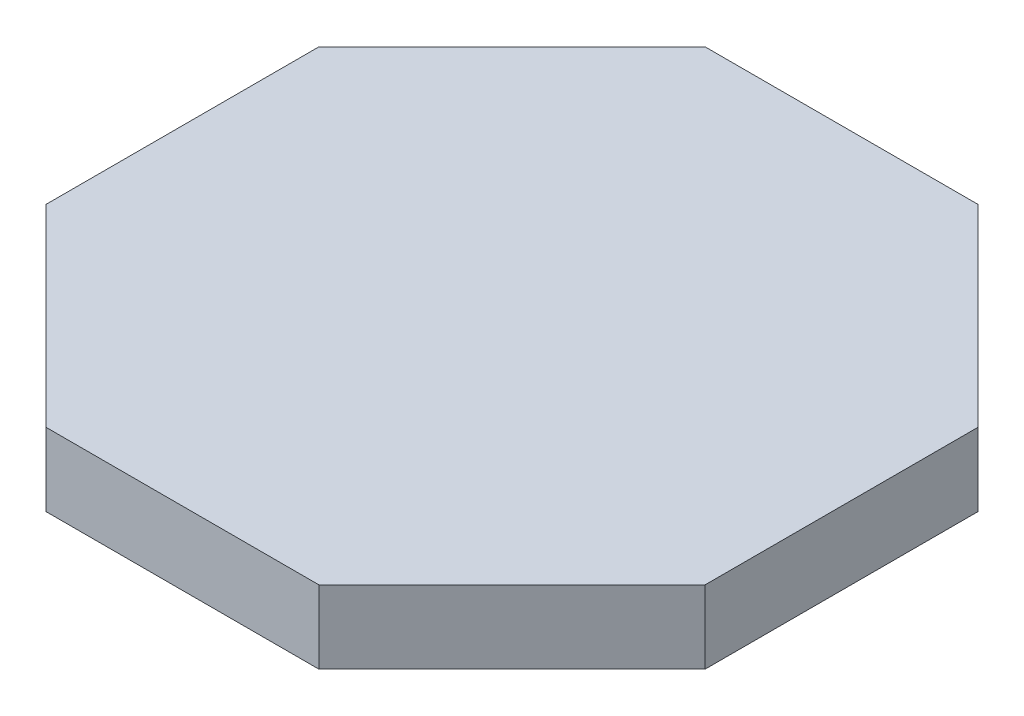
ISO-10303-21;
HEADER;
FILE_DESCRIPTION(('STEP AP214'),'2;1');
FILE_NAME('part.step','',(''),(''),'','','');
FILE_SCHEMA(('AUTOMOTIVE_DESIGN { 1 0 10303 214 1 1 1 1 }'));
ENDSEC;
DATA;
#1=APPLICATION_CONTEXT('core data for automotive mechanical design processes');
#2=APPLICATION_PROTOCOL_DEFINITION('international standard','automotive_design',2000,#1);
#3=PRODUCT_CONTEXT('',#1,'mechanical');
#4=PRODUCT('Part','Part','',(#3));
#5=PRODUCT_RELATED_PRODUCT_CATEGORY('part','',(#4));
#6=PRODUCT_DEFINITION_FORMATION('','',#4);
#7=PRODUCT_DEFINITION_CONTEXT('part definition',#1,'design');
#8=PRODUCT_DEFINITION('design','',#6,#7);
#9=PRODUCT_DEFINITION_SHAPE('','',#8);
#10=(LENGTH_UNIT() NAMED_UNIT(*) SI_UNIT(.MILLI.,.METRE.));
#11=(NAMED_UNIT(*) PLANE_ANGLE_UNIT() SI_UNIT($,.RADIAN.));
#12=(NAMED_UNIT(*) SI_UNIT($,.STERADIAN.) SOLID_ANGLE_UNIT());
#13=UNCERTAINTY_MEASURE_WITH_UNIT(LENGTH_MEASURE(1.E-05),#10,'distance_accuracy_value','');
#14=(GEOMETRIC_REPRESENTATION_CONTEXT(3) GLOBAL_UNCERTAINTY_ASSIGNED_CONTEXT((#13)) GLOBAL_UNIT_ASSIGNED_CONTEXT((#10,
#11,#12)) REPRESENTATION_CONTEXT('',''));
#15=CARTESIAN_POINT('',(0.,0.,0.));
#16=DIRECTION('',(0.,0.,1.));
#17=DIRECTION('',(1.,0.,0.));
#18=AXIS2_PLACEMENT_3D('',#15,#16,#17);
#19=CARTESIAN_POINT('',(36.0924927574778,8.,-14.95));
#20=DIRECTION('',(-0.707106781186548,0.,0.707106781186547));
#21=DIRECTION('',(0.707106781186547,0.,0.707106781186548));
#22=AXIS2_PLACEMENT_3D('',#19,#20,#21);
#23=PLANE('',#22);
#24=DIRECTION('',(-0.707106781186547,0.,-0.707106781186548));
#25=VECTOR('',#24,1.);
#26=CARTESIAN_POINT('',(36.0924927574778,0.,-14.95));
#27=LINE('',#26,#25);
#28=CARTESIAN_POINT('',(36.0924927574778,0.,-14.95));
#29=VERTEX_POINT('',#28);
#30=CARTESIAN_POINT('',(14.95,0.,-36.0924927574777));
#31=VERTEX_POINT('',#30);
#32=EDGE_CURVE('E129',#29,#31,#27,.T.);
#33=ORIENTED_EDGE('',*,*,#32,.T.);
#34=DIRECTION('',(0.,-1.,0.));
#35=VECTOR('',#34,1.);
#36=CARTESIAN_POINT('',(14.95,8.,-36.0924927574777));
#37=LINE('',#36,#35);
#38=CARTESIAN_POINT('',(14.95,8.,-36.0924927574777));
#39=VERTEX_POINT('',#38);
#40=EDGE_CURVE('E11',#39,#31,#37,.T.);
#41=ORIENTED_EDGE('',*,*,#40,.F.);
#42=DIRECTION('',(-0.707106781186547,0.,-0.707106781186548));
#43=VECTOR('',#42,1.);
#44=CARTESIAN_POINT('',(36.0924927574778,8.,-14.95));
#45=LINE('',#44,#43);
#46=CARTESIAN_POINT('',(36.0924927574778,8.,-14.95));
#47=VERTEX_POINT('',#46);
#48=EDGE_CURVE('E143',#47,#39,#45,.T.);
#49=ORIENTED_EDGE('',*,*,#48,.F.);
#50=DIRECTION('',(0.,-1.,0.));
#51=VECTOR('',#50,1.);
#52=CARTESIAN_POINT('',(36.0924927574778,8.,-14.95));
#53=LINE('',#52,#51);
#54=EDGE_CURVE('E125',#47,#29,#53,.T.);
#55=ORIENTED_EDGE('',*,*,#54,.T.);
#56=EDGE_LOOP('',(#33,#41,#49,#55));
#57=FACE_BOUND('',#56,.T.);
#58=ADVANCED_FACE('F33',(#57),#23,.F.);
#59=CARTESIAN_POINT('',(14.95,8.,-36.0924927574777));
#60=DIRECTION('',(0.,0.,1.));
#61=DIRECTION('',(1.,0.,0.));
#62=AXIS2_PLACEMENT_3D('',#59,#60,#61);
#63=PLANE('',#62);
#64=DIRECTION('',(-1.,0.,0.));
#65=VECTOR('',#64,1.);
#66=CARTESIAN_POINT('',(14.95,0.,-36.0924927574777));
#67=LINE('',#66,#65);
#68=CARTESIAN_POINT('',(-14.95,0.,-36.0924927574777));
#69=VERTEX_POINT('',#68);
#70=EDGE_CURVE('E132',#31,#69,#67,.T.);
#71=ORIENTED_EDGE('',*,*,#70,.T.);
#72=DIRECTION('',(0.,-1.,0.));
#73=VECTOR('',#72,1.);
#74=CARTESIAN_POINT('',(-14.95,8.,-36.0924927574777));
#75=LINE('',#74,#73);
#76=CARTESIAN_POINT('',(-14.95,8.,-36.0924927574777));
#77=VERTEX_POINT('',#76);
#78=EDGE_CURVE('E41',#77,#69,#75,.T.);
#79=ORIENTED_EDGE('',*,*,#78,.F.);
#80=DIRECTION('',(-1.,0.,0.));
#81=VECTOR('',#80,1.);
#82=CARTESIAN_POINT('',(14.95,8.,-36.0924927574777));
#83=LINE('',#82,#81);
#84=EDGE_CURVE('E92',#39,#77,#83,.T.);
#85=ORIENTED_EDGE('',*,*,#84,.F.);
#86=ORIENTED_EDGE('',*,*,#40,.T.);
#87=EDGE_LOOP('',(#71,#79,#85,#86));
#88=FACE_BOUND('',#87,.T.);
#89=ADVANCED_FACE('F178',(#88),#63,.F.);
#90=CARTESIAN_POINT('',(-14.95,8.,-36.0924927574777));
#91=DIRECTION('',(0.707106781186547,0.,0.707106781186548));
#92=DIRECTION('',(0.707106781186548,0.,-0.707106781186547));
#93=AXIS2_PLACEMENT_3D('',#90,#91,#92);
#94=PLANE('',#93);
#95=DIRECTION('',(-0.707106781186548,0.,0.707106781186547));
#96=VECTOR('',#95,1.);
#97=CARTESIAN_POINT('',(-14.95,0.,-36.0924927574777));
#98=LINE('',#97,#96);
#99=CARTESIAN_POINT('',(-36.0924927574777,0.,-14.95));
#100=VERTEX_POINT('',#99);
#101=EDGE_CURVE('E134',#69,#100,#98,.T.);
#102=ORIENTED_EDGE('',*,*,#101,.T.);
#103=DIRECTION('',(0.,-1.,0.));
#104=VECTOR('',#103,1.);
#105=CARTESIAN_POINT('',(-36.0924927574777,8.,-14.95));
#106=LINE('',#105,#104);
#107=CARTESIAN_POINT('',(-36.0924927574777,8.,-14.95));
#108=VERTEX_POINT('',#107);
#109=EDGE_CURVE('E150',#108,#100,#106,.T.);
#110=ORIENTED_EDGE('',*,*,#109,.F.);
#111=DIRECTION('',(-0.707106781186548,0.,0.707106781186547));
#112=VECTOR('',#111,1.);
#113=CARTESIAN_POINT('',(-14.95,8.,-36.0924927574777));
#114=LINE('',#113,#112);
#115=EDGE_CURVE('E158',#77,#108,#114,.T.);
#116=ORIENTED_EDGE('',*,*,#115,.F.);
#117=ORIENTED_EDGE('',*,*,#78,.T.);
#118=EDGE_LOOP('',(#102,#110,#116,#117));
#119=FACE_BOUND('',#118,.T.);
#120=ADVANCED_FACE('F156',(#119),#94,.F.);
#121=CARTESIAN_POINT('',(-36.0924927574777,8.,-14.95));
#122=DIRECTION('',(1.,0.,0.));
#123=DIRECTION('',(0.,0.,-1.));
#124=AXIS2_PLACEMENT_3D('',#121,#122,#123);
#125=PLANE('',#124);
#126=DIRECTION('',(0.,0.,1.));
#127=VECTOR('',#126,1.);
#128=CARTESIAN_POINT('',(-36.0924927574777,0.,-14.95));
#129=LINE('',#128,#127);
#130=CARTESIAN_POINT('',(-36.0924927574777,0.,14.95));
#131=VERTEX_POINT('',#130);
#132=EDGE_CURVE('E136',#100,#131,#129,.T.);
#133=ORIENTED_EDGE('',*,*,#132,.T.);
#134=DIRECTION('',(0.,-1.,0.));
#135=VECTOR('',#134,1.);
#136=CARTESIAN_POINT('',(-36.0924927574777,8.,14.95));
#137=LINE('',#136,#135);
#138=CARTESIAN_POINT('',(-36.0924927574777,8.,14.95));
#139=VERTEX_POINT('',#138);
#140=EDGE_CURVE('E147',#139,#131,#137,.T.);
#141=ORIENTED_EDGE('',*,*,#140,.F.);
#142=DIRECTION('',(0.,0.,1.));
#143=VECTOR('',#142,1.);
#144=CARTESIAN_POINT('',(-36.0924927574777,8.,-14.95));
#145=LINE('',#144,#143);
#146=EDGE_CURVE('E170',#108,#139,#145,.T.);
#147=ORIENTED_EDGE('',*,*,#146,.F.);
#148=ORIENTED_EDGE('',*,*,#109,.T.);
#149=EDGE_LOOP('',(#133,#141,#147,#148));
#150=FACE_BOUND('',#149,.T.);
#151=ADVANCED_FACE('F166',(#150),#125,.F.);
#152=CARTESIAN_POINT('',(-36.0924927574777,8.,14.95));
#153=DIRECTION('',(0.707106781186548,0.,-0.707106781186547));
#154=DIRECTION('',(-0.707106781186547,0.,-0.707106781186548));
#155=AXIS2_PLACEMENT_3D('',#152,#153,#154);
#156=PLANE('',#155);
#157=DIRECTION('',(0.707106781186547,0.,0.707106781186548));
#158=VECTOR('',#157,1.);
#159=CARTESIAN_POINT('',(-36.0924927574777,0.,14.95));
#160=LINE('',#159,#158);
#161=CARTESIAN_POINT('',(-14.95,0.,36.0924927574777));
#162=VERTEX_POINT('',#161);
#163=EDGE_CURVE('E138',#131,#162,#160,.T.);
#164=ORIENTED_EDGE('',*,*,#163,.T.);
#165=DIRECTION('',(0.,-1.,0.));
#166=VECTOR('',#165,1.);
#167=CARTESIAN_POINT('',(-14.95,8.,36.0924927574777));
#168=LINE('',#167,#166);
#169=CARTESIAN_POINT('',(-14.95,8.,36.0924927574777));
#170=VERTEX_POINT('',#169);
#171=EDGE_CURVE('E120',#170,#162,#168,.T.);
#172=ORIENTED_EDGE('',*,*,#171,.F.);
#173=DIRECTION('',(0.707106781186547,0.,0.707106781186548));
#174=VECTOR('',#173,1.);
#175=CARTESIAN_POINT('',(-36.0924927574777,8.,14.95));
#176=LINE('',#175,#174);
#177=EDGE_CURVE('E111',#139,#170,#176,.T.);
#178=ORIENTED_EDGE('',*,*,#177,.F.);
#179=ORIENTED_EDGE('',*,*,#140,.T.);
#180=EDGE_LOOP('',(#164,#172,#178,#179));
#181=FACE_BOUND('',#180,.T.);
#182=ADVANCED_FACE('F169',(#181),#156,.F.);
#183=CARTESIAN_POINT('',(-14.95,8.,36.0924927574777));
#184=DIRECTION('',(0.,0.,-1.));
#185=DIRECTION('',(-1.,0.,0.));
#186=AXIS2_PLACEMENT_3D('',#183,#184,#185);
#187=PLANE('',#186);
#188=DIRECTION('',(1.,0.,0.));
#189=VECTOR('',#188,1.);
#190=CARTESIAN_POINT('',(-14.95,0.,36.0924927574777));
#191=LINE('',#190,#189);
#192=CARTESIAN_POINT('',(14.95,0.,36.0924927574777));
#193=VERTEX_POINT('',#192);
#194=EDGE_CURVE('E119',#162,#193,#191,.T.);
#195=ORIENTED_EDGE('',*,*,#194,.T.);
#196=DIRECTION('',(0.,-1.,0.));
#197=VECTOR('',#196,1.);
#198=CARTESIAN_POINT('',(14.95,8.,36.0924927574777));
#199=LINE('',#198,#197);
#200=CARTESIAN_POINT('',(14.95,8.,36.0924927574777));
#201=VERTEX_POINT('',#200);
#202=EDGE_CURVE('E116',#201,#193,#199,.T.);
#203=ORIENTED_EDGE('',*,*,#202,.F.);
#204=DIRECTION('',(1.,0.,0.));
#205=VECTOR('',#204,1.);
#206=CARTESIAN_POINT('',(-14.95,8.,36.0924927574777));
#207=LINE('',#206,#205);
#208=EDGE_CURVE('E105',#170,#201,#207,.T.);
#209=ORIENTED_EDGE('',*,*,#208,.F.);
#210=ORIENTED_EDGE('',*,*,#171,.T.);
#211=EDGE_LOOP('',(#195,#203,#209,#210));
#212=FACE_BOUND('',#211,.T.);
#213=ADVANCED_FACE('F117',(#212),#187,.F.);
#214=CARTESIAN_POINT('',(14.95,8.,36.0924927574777));
#215=DIRECTION('',(-0.707106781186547,0.,-0.707106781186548));
#216=DIRECTION('',(-0.707106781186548,0.,0.707106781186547));
#217=AXIS2_PLACEMENT_3D('',#214,#215,#216);
#218=PLANE('',#217);
#219=DIRECTION('',(0.707106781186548,0.,-0.707106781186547));
#220=VECTOR('',#219,1.);
#221=CARTESIAN_POINT('',(14.95,0.,36.0924927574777));
#222=LINE('',#221,#220);
#223=CARTESIAN_POINT('',(36.0924927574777,0.,14.95));
#224=VERTEX_POINT('',#223);
#225=EDGE_CURVE('E78',#193,#224,#222,.T.);
#226=ORIENTED_EDGE('',*,*,#225,.T.);
#227=DIRECTION('',(0.,-1.,0.));
#228=VECTOR('',#227,1.);
#229=CARTESIAN_POINT('',(36.0924927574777,8.,14.95));
#230=LINE('',#229,#228);
#231=CARTESIAN_POINT('',(36.0924927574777,8.,14.95));
#232=VERTEX_POINT('',#231);
#233=EDGE_CURVE('E121',#232,#224,#230,.T.);
#234=ORIENTED_EDGE('',*,*,#233,.F.);
#235=DIRECTION('',(0.707106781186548,0.,-0.707106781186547));
#236=VECTOR('',#235,1.);
#237=CARTESIAN_POINT('',(14.95,8.,36.0924927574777));
#238=LINE('',#237,#236);
#239=EDGE_CURVE('E109',#201,#232,#238,.T.);
#240=ORIENTED_EDGE('',*,*,#239,.F.);
#241=ORIENTED_EDGE('',*,*,#202,.T.);
#242=EDGE_LOOP('',(#226,#234,#240,#241));
#243=FACE_BOUND('',#242,.T.);
#244=ADVANCED_FACE('F123',(#243),#218,.F.);
#245=CARTESIAN_POINT('',(36.0924927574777,8.,14.95));
#246=DIRECTION('',(-1.,0.,0.));
#247=DIRECTION('',(0.,0.,1.));
#248=AXIS2_PLACEMENT_3D('',#245,#246,#247);
#249=PLANE('',#248);
#250=DIRECTION('',(0.,0.,-1.));
#251=VECTOR('',#250,1.);
#252=CARTESIAN_POINT('',(36.0924927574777,0.,14.95));
#253=LINE('',#252,#251);
#254=EDGE_CURVE('E84',#224,#29,#253,.T.);
#255=ORIENTED_EDGE('',*,*,#254,.T.);
#256=ORIENTED_EDGE('',*,*,#54,.F.);
#257=DIRECTION('',(0.,0.,-1.));
#258=VECTOR('',#257,1.);
#259=CARTESIAN_POINT('',(36.0924927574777,8.,14.95));
#260=LINE('',#259,#258);
#261=EDGE_CURVE('E49',#232,#47,#260,.T.);
#262=ORIENTED_EDGE('',*,*,#261,.F.);
#263=ORIENTED_EDGE('',*,*,#233,.T.);
#264=EDGE_LOOP('',(#255,#256,#262,#263));
#265=FACE_BOUND('',#264,.T.);
#266=ADVANCED_FACE('F194',(#265),#249,.F.);
#267=CARTESIAN_POINT('',(0.,8.,0.));
#268=DIRECTION('',(0.,1.,0.));
#269=DIRECTION('',(0.,0.,1.));
#270=AXIS2_PLACEMENT_3D('',#267,#268,#269);
#271=PLANE('',#270);
#272=ORIENTED_EDGE('',*,*,#48,.T.);
#273=ORIENTED_EDGE('',*,*,#84,.T.);
#274=ORIENTED_EDGE('',*,*,#115,.T.);
#275=ORIENTED_EDGE('',*,*,#146,.T.);
#276=ORIENTED_EDGE('',*,*,#177,.T.);
#277=ORIENTED_EDGE('',*,*,#208,.T.);
#278=ORIENTED_EDGE('',*,*,#239,.T.);
#279=ORIENTED_EDGE('',*,*,#261,.T.);
#280=EDGE_LOOP('',(#272,#273,#274,#275,#276,#277,#278,#279));
#281=FACE_BOUND('',#280,.T.);
#282=ADVANCED_FACE('F107',(#281),#271,.T.);
#283=CARTESIAN_POINT('',(0.,0.,0.));
#284=DIRECTION('',(0.,1.,0.));
#285=DIRECTION('',(0.,0.,1.));
#286=AXIS2_PLACEMENT_3D('',#283,#284,#285);
#287=PLANE('',#286);
#288=ORIENTED_EDGE('',*,*,#32,.F.);
#289=ORIENTED_EDGE('',*,*,#254,.F.);
#290=ORIENTED_EDGE('',*,*,#225,.F.);
#291=ORIENTED_EDGE('',*,*,#194,.F.);
#292=ORIENTED_EDGE('',*,*,#163,.F.);
#293=ORIENTED_EDGE('',*,*,#132,.F.);
#294=ORIENTED_EDGE('',*,*,#101,.F.);
#295=ORIENTED_EDGE('',*,*,#70,.F.);
#296=EDGE_LOOP('',(#288,#289,#290,#291,#292,#293,#294,#295));
#297=FACE_BOUND('',#296,.T.);
#298=ADVANCED_FACE('F162',(#297),#287,.F.);
#299=CLOSED_SHELL('',(#58,#89,#120,#151,#182,#213,#244,#266,#282,#298));
#300=MANIFOLD_SOLID_BREP('B2',#299);
#301=ADVANCED_BREP_SHAPE_REPRESENTATION('',(#18,#300),#14);
#302=SHAPE_DEFINITION_REPRESENTATION(#9,#301);
ENDSEC;
END-ISO-10303-21;
